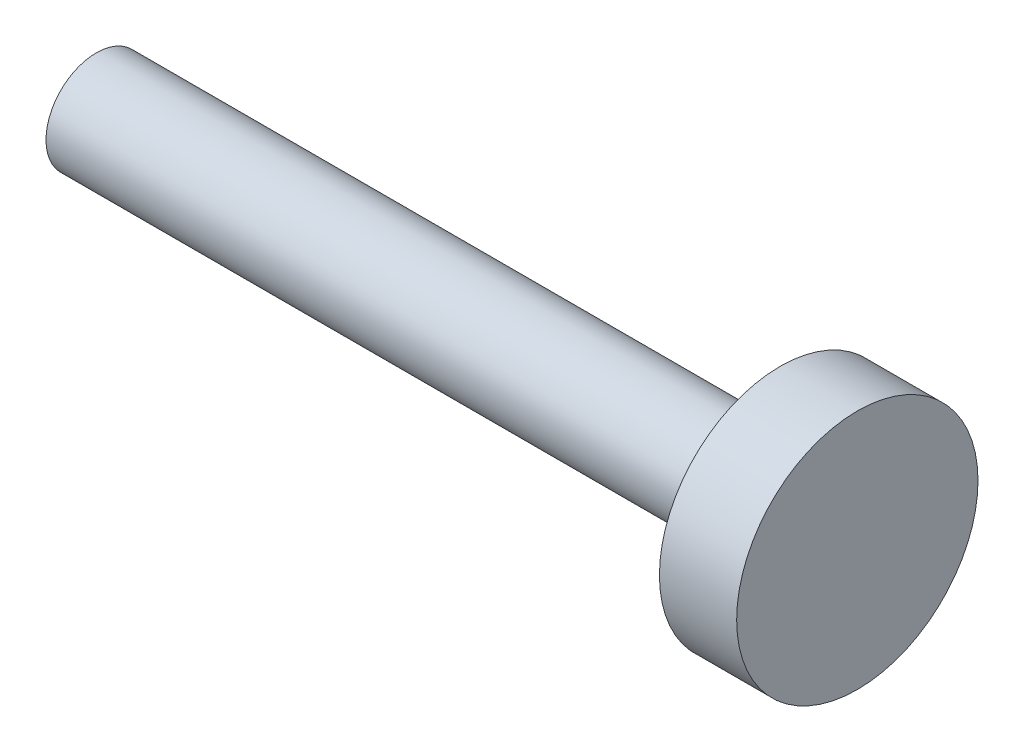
ISO-10303-21;
HEADER;
FILE_DESCRIPTION(('STEP AP214'),'2;1');
FILE_NAME('part.step','',(''),(''),'','','');
FILE_SCHEMA(('AUTOMOTIVE_DESIGN { 1 0 10303 214 1 1 1 1 }'));
ENDSEC;
DATA;
#1=APPLICATION_CONTEXT('core data for automotive mechanical design processes');
#2=APPLICATION_PROTOCOL_DEFINITION('international standard','automotive_design',2000,#1);
#3=PRODUCT_CONTEXT('',#1,'mechanical');
#4=PRODUCT('Part','Part','',(#3));
#5=PRODUCT_RELATED_PRODUCT_CATEGORY('part','',(#4));
#6=PRODUCT_DEFINITION_FORMATION('','',#4);
#7=PRODUCT_DEFINITION_CONTEXT('part definition',#1,'design');
#8=PRODUCT_DEFINITION('design','',#6,#7);
#9=PRODUCT_DEFINITION_SHAPE('','',#8);
#10=(LENGTH_UNIT() NAMED_UNIT(*) SI_UNIT(.MILLI.,.METRE.));
#11=(NAMED_UNIT(*) PLANE_ANGLE_UNIT() SI_UNIT($,.RADIAN.));
#12=(NAMED_UNIT(*) SI_UNIT($,.STERADIAN.) SOLID_ANGLE_UNIT());
#13=UNCERTAINTY_MEASURE_WITH_UNIT(LENGTH_MEASURE(1.E-05),#10,'distance_accuracy_value','');
#14=(GEOMETRIC_REPRESENTATION_CONTEXT(3) GLOBAL_UNCERTAINTY_ASSIGNED_CONTEXT((#13)) GLOBAL_UNIT_ASSIGNED_CONTEXT((#10,
#11,#12)) REPRESENTATION_CONTEXT('',''));
#15=CARTESIAN_POINT('',(0.,0.,0.));
#16=DIRECTION('',(0.,0.,1.));
#17=DIRECTION('',(1.,0.,0.));
#18=AXIS2_PLACEMENT_3D('',#15,#16,#17);
#19=CARTESIAN_POINT('',(0.,0.,0.));
#20=DIRECTION('',(1.,0.,0.));
#21=DIRECTION('',(0.,0.,-1.));
#22=AXIS2_PLACEMENT_3D('',#19,#20,#21);
#23=PLANE('',#22);
#24=CARTESIAN_POINT('',(0.,0.,0.));
#25=DIRECTION('',(-1.,0.,0.));
#26=DIRECTION('',(0.,0.,1.));
#27=AXIS2_PLACEMENT_3D('',#24,#25,#26);
#28=CIRCLE('',#27,1.5875);
#29=CARTESIAN_POINT('',(0.,0.,1.5875));
#30=VERTEX_POINT('',#29);
#31=EDGE_CURVE('E10',#30,#30,#28,.T.);
#32=ORIENTED_EDGE('',*,*,#31,.T.);
#33=EDGE_LOOP('',(#32));
#34=FACE_BOUND('',#33,.T.);
#35=ADVANCED_FACE('F30',(#34),#23,.F.);
#36=CARTESIAN_POINT('',(24.0284,0.,0.));
#37=DIRECTION('',(-1.,0.,0.));
#38=DIRECTION('',(0.,0.,1.));
#39=AXIS2_PLACEMENT_3D('',#36,#37,#38);
#40=CYLINDRICAL_SURFACE('',#39,1.5875);
#41=ORIENTED_EDGE('',*,*,#31,.F.);
#42=EDGE_LOOP('',(#41));
#43=FACE_BOUND('',#42,.T.);
#44=CARTESIAN_POINT('',(21.59,0.,0.));
#45=DIRECTION('',(-1.,0.,0.));
#46=DIRECTION('',(0.,0.,1.));
#47=AXIS2_PLACEMENT_3D('',#44,#45,#46);
#48=CIRCLE('',#47,1.5875);
#49=CARTESIAN_POINT('',(21.59,0.,1.5875));
#50=VERTEX_POINT('',#49);
#51=EDGE_CURVE('E36',#50,#50,#48,.T.);
#52=ORIENTED_EDGE('',*,*,#51,.T.);
#53=EDGE_LOOP('',(#52));
#54=FACE_BOUND('',#53,.T.);
#55=ADVANCED_FACE('F62',(#43,#54),#40,.T.);
#56=CARTESIAN_POINT('',(21.59,1.5875,0.));
#57=DIRECTION('',(1.,0.,0.));
#58=DIRECTION('',(0.,0.,-1.));
#59=AXIS2_PLACEMENT_3D('',#56,#57,#58);
#60=PLANE('',#59);
#61=ORIENTED_EDGE('',*,*,#51,.F.);
#62=EDGE_LOOP('',(#61));
#63=FACE_BOUND('',#62,.T.);
#64=CARTESIAN_POINT('',(21.59,0.,0.));
#65=DIRECTION('',(-1.,0.,0.));
#66=DIRECTION('',(0.,0.,1.));
#67=AXIS2_PLACEMENT_3D('',#64,#65,#66);
#68=CIRCLE('',#67,3.81);
#69=CARTESIAN_POINT('',(21.59,0.,3.81));
#70=VERTEX_POINT('',#69);
#71=EDGE_CURVE('E40',#70,#70,#68,.T.);
#72=ORIENTED_EDGE('',*,*,#71,.T.);
#73=EDGE_LOOP('',(#72));
#74=FACE_BOUND('',#73,.T.);
#75=ADVANCED_FACE('F58',(#63,#74),#60,.F.);
#76=CARTESIAN_POINT('',(24.0284,0.,0.));
#77=DIRECTION('',(-1.,0.,0.));
#78=DIRECTION('',(0.,0.,1.));
#79=AXIS2_PLACEMENT_3D('',#76,#77,#78);
#80=CYLINDRICAL_SURFACE('',#79,3.81);
#81=ORIENTED_EDGE('',*,*,#71,.F.);
#82=EDGE_LOOP('',(#81));
#83=FACE_BOUND('',#82,.T.);
#84=CARTESIAN_POINT('',(24.0284,0.,0.));
#85=DIRECTION('',(-1.,0.,0.));
#86=DIRECTION('',(0.,0.,1.));
#87=AXIS2_PLACEMENT_3D('',#84,#85,#86);
#88=CIRCLE('',#87,3.81);
#89=CARTESIAN_POINT('',(24.0284,0.,3.81));
#90=VERTEX_POINT('',#89);
#91=EDGE_CURVE('E44',#90,#90,#88,.T.);
#92=ORIENTED_EDGE('',*,*,#91,.T.);
#93=EDGE_LOOP('',(#92));
#94=FACE_BOUND('',#93,.T.);
#95=ADVANCED_FACE('F50',(#83,#94),#80,.T.);
#96=CARTESIAN_POINT('',(24.0284,3.81,0.));
#97=DIRECTION('',(-1.,0.,0.));
#98=DIRECTION('',(0.,0.,1.));
#99=AXIS2_PLACEMENT_3D('',#96,#97,#98);
#100=PLANE('',#99);
#101=ORIENTED_EDGE('',*,*,#91,.F.);
#102=EDGE_LOOP('',(#101));
#103=FACE_BOUND('',#102,.T.);
#104=ADVANCED_FACE('F52',(#103),#100,.F.);
#105=CLOSED_SHELL('',(#35,#55,#75,#95,#104));
#106=MANIFOLD_SOLID_BREP('B2',#105);
#107=ADVANCED_BREP_SHAPE_REPRESENTATION('',(#18,#106),#14);
#108=SHAPE_DEFINITION_REPRESENTATION(#9,#107);
ENDSEC;
END-ISO-10303-21;
